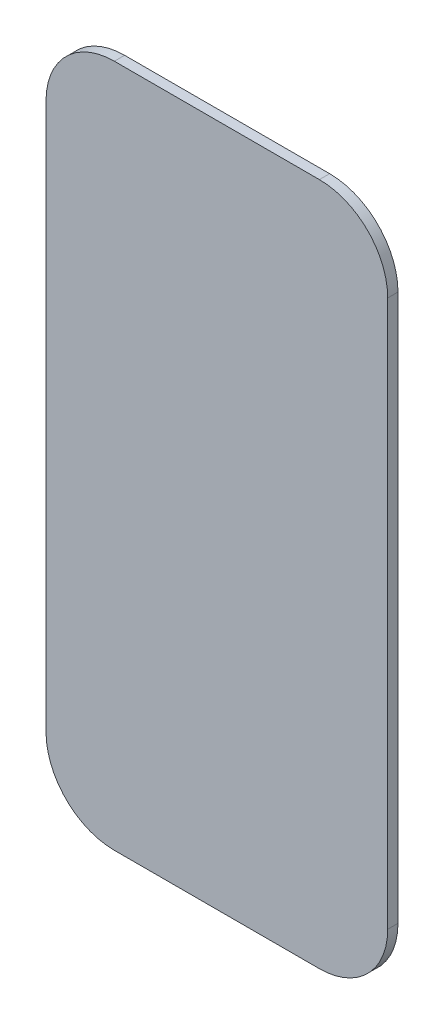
from build123d import *

# Parameters (mm, degrees)
BOSS_EXTRUDE1_DEPTH = 3


with BuildPart() as part:
    # Sketch1 → Boss-Extrude1 (new body)
    with BuildSketch(Plane.XY):
        with BuildLine():
            Line((30, -100), (-30, -100))
            ThreePointArc((-30, -100), (-44.142135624, -94.142135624), (-50, -80))
            Line((-50, -80), (-50, 80))
            ThreePointArc((-50, 80), (-44.142135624, 94.142135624), (-30, 100))
            Line((-30, 100), (30, 100))
            ThreePointArc((30, 100), (44.142135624, 94.142135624), (50, 80))
            Line((50, 80), (50, -80))
            ThreePointArc((50, -80), (44.142135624, -94.142135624), (30, -100))
        make_face()
    extrude(amount=BOSS_EXTRUDE1_DEPTH)


solid = part.part
